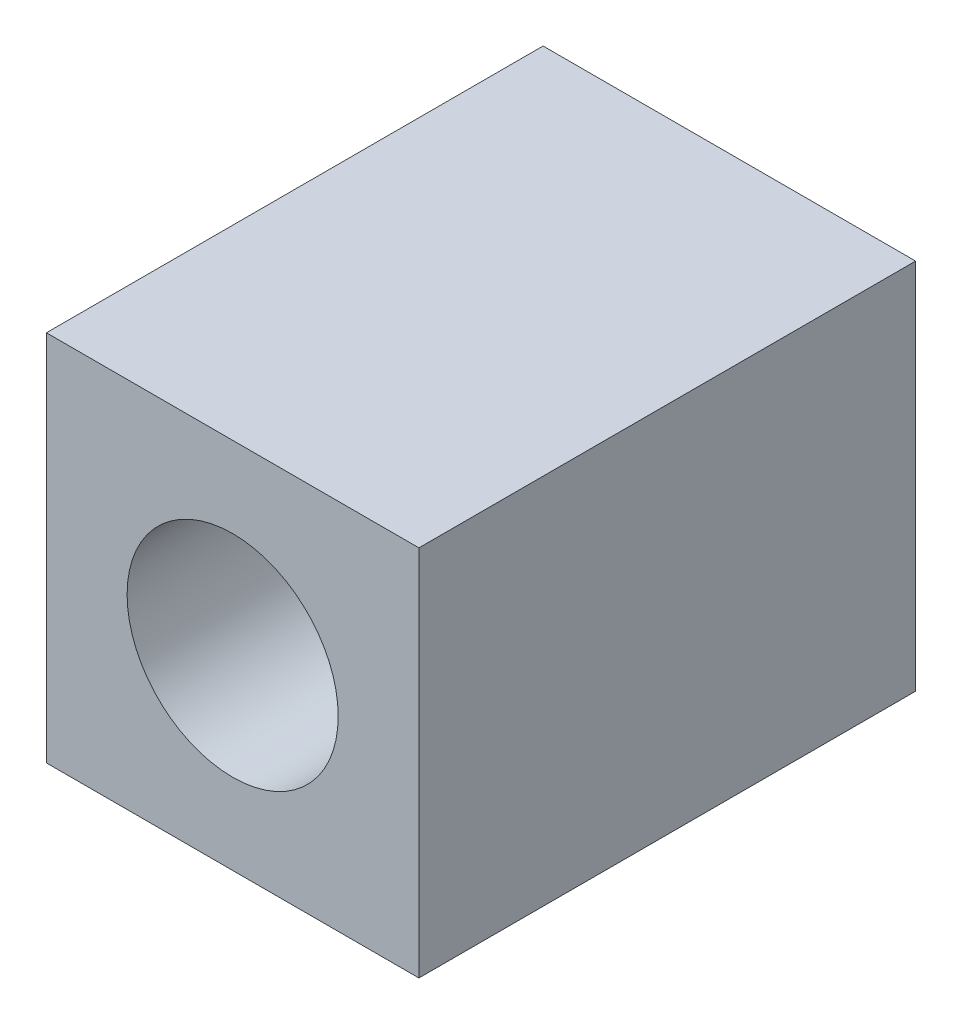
from build123d import *

# Parameters (mm, degrees)
ESQUISSE1_W          = 30
ESQUISSE1_H          = 30
ESQUISSE1_R          = 8.5
BASE_EXTRUSION_DEPTH = 40


with BuildPart() as part:
    # Esquisse1 → Base-Extrusion (new body)
    with BuildSketch(Plane.XY):
        Rectangle(ESQUISSE1_W, ESQUISSE1_H)
        Circle(ESQUISSE1_R, mode=Mode.SUBTRACT)
    extrude(amount=-BASE_EXTRUSION_DEPTH)


solid = part.part
